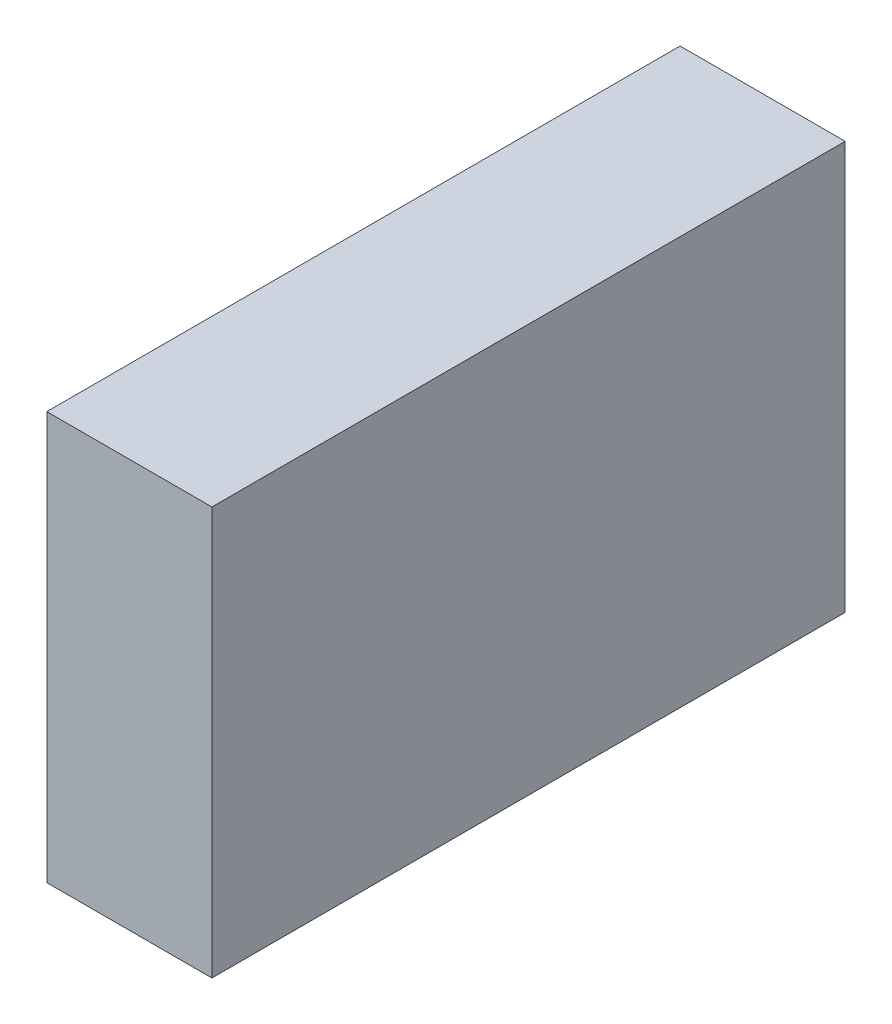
ISO-10303-21;
HEADER;
FILE_DESCRIPTION(('STEP AP214'),'2;1');
FILE_NAME('part.step','',(''),(''),'','','');
FILE_SCHEMA(('AUTOMOTIVE_DESIGN { 1 0 10303 214 1 1 1 1 }'));
ENDSEC;
DATA;
#1=APPLICATION_CONTEXT('core data for automotive mechanical design processes');
#2=APPLICATION_PROTOCOL_DEFINITION('international standard','automotive_design',2000,#1);
#3=PRODUCT_CONTEXT('',#1,'mechanical');
#4=PRODUCT('Part','Part','',(#3));
#5=PRODUCT_RELATED_PRODUCT_CATEGORY('part','',(#4));
#6=PRODUCT_DEFINITION_FORMATION('','',#4);
#7=PRODUCT_DEFINITION_CONTEXT('part definition',#1,'design');
#8=PRODUCT_DEFINITION('design','',#6,#7);
#9=PRODUCT_DEFINITION_SHAPE('','',#8);
#10=(LENGTH_UNIT() NAMED_UNIT(*) SI_UNIT(.MILLI.,.METRE.));
#11=(NAMED_UNIT(*) PLANE_ANGLE_UNIT() SI_UNIT($,.RADIAN.));
#12=(NAMED_UNIT(*) SI_UNIT($,.STERADIAN.) SOLID_ANGLE_UNIT());
#13=UNCERTAINTY_MEASURE_WITH_UNIT(LENGTH_MEASURE(1.E-05),#10,'distance_accuracy_value','');
#14=(GEOMETRIC_REPRESENTATION_CONTEXT(3) GLOBAL_UNCERTAINTY_ASSIGNED_CONTEXT((#13)) GLOBAL_UNIT_ASSIGNED_CONTEXT((#10,
#11,#12)) REPRESENTATION_CONTEXT('',''));
#15=CARTESIAN_POINT('',(0.,0.,0.));
#16=DIRECTION('',(0.,0.,1.));
#17=DIRECTION('',(1.,0.,0.));
#18=AXIS2_PLACEMENT_3D('',#15,#16,#17);
#19=CARTESIAN_POINT('',(-42.5,210.,-163.));
#20=DIRECTION('',(-1.,0.,0.));
#21=DIRECTION('',(0.,-1.,0.));
#22=AXIS2_PLACEMENT_3D('',#19,#20,#21);
#23=PLANE('',#22);
#24=DIRECTION('',(0.,-1.,0.));
#25=VECTOR('',#24,1.);
#26=CARTESIAN_POINT('',(-42.5,210.,163.));
#27=LINE('',#26,#25);
#28=CARTESIAN_POINT('',(-42.5,210.,163.));
#29=VERTEX_POINT('',#28);
#30=CARTESIAN_POINT('',(-42.5,0.,163.));
#31=VERTEX_POINT('',#30);
#32=EDGE_CURVE('E120',#29,#31,#27,.T.);
#33=ORIENTED_EDGE('',*,*,#32,.F.);
#34=DIRECTION('',(0.,0.,1.));
#35=VECTOR('',#34,1.);
#36=CARTESIAN_POINT('',(-42.5,210.,-163.));
#37=LINE('',#36,#35);
#38=CARTESIAN_POINT('',(-42.5,210.,-163.));
#39=VERTEX_POINT('',#38);
#40=EDGE_CURVE('E11',#39,#29,#37,.T.);
#41=ORIENTED_EDGE('',*,*,#40,.F.);
#42=DIRECTION('',(0.,-1.,0.));
#43=VECTOR('',#42,1.);
#44=CARTESIAN_POINT('',(-42.5,210.,-163.));
#45=LINE('',#44,#43);
#46=CARTESIAN_POINT('',(-42.5,0.,-163.));
#47=VERTEX_POINT('',#46);
#48=EDGE_CURVE('E107',#39,#47,#45,.T.);
#49=ORIENTED_EDGE('',*,*,#48,.T.);
#50=DIRECTION('',(0.,0.,1.));
#51=VECTOR('',#50,1.);
#52=CARTESIAN_POINT('',(-42.5,0.,-163.));
#53=LINE('',#52,#51);
#54=EDGE_CURVE('E52',#47,#31,#53,.T.);
#55=ORIENTED_EDGE('',*,*,#54,.T.);
#56=EDGE_LOOP('',(#33,#41,#49,#55));
#57=FACE_BOUND('',#56,.T.);
#58=ADVANCED_FACE('F49',(#57),#23,.T.);
#59=CARTESIAN_POINT('',(-42.5,210.,-163.));
#60=DIRECTION('',(0.,1.,0.));
#61=DIRECTION('',(-1.,0.,0.));
#62=AXIS2_PLACEMENT_3D('',#59,#60,#61);
#63=PLANE('',#62);
#64=ORIENTED_EDGE('',*,*,#40,.T.);
#65=DIRECTION('',(-1.,0.,0.));
#66=VECTOR('',#65,1.);
#67=CARTESIAN_POINT('',(-42.5,210.,163.));
#68=LINE('',#67,#66);
#69=CARTESIAN_POINT('',(42.5,210.,163.));
#70=VERTEX_POINT('',#69);
#71=EDGE_CURVE('E89',#70,#29,#68,.T.);
#72=ORIENTED_EDGE('',*,*,#71,.F.);
#73=DIRECTION('',(0.,0.,1.));
#74=VECTOR('',#73,1.);
#75=CARTESIAN_POINT('',(42.5,210.,-163.));
#76=LINE('',#75,#74);
#77=CARTESIAN_POINT('',(42.5,210.,-163.));
#78=VERTEX_POINT('',#77);
#79=EDGE_CURVE('E59',#78,#70,#76,.T.);
#80=ORIENTED_EDGE('',*,*,#79,.F.);
#81=DIRECTION('',(-1.,0.,0.));
#82=VECTOR('',#81,1.);
#83=CARTESIAN_POINT('',(-42.5,210.,-163.));
#84=LINE('',#83,#82);
#85=EDGE_CURVE('E67',#78,#39,#84,.T.);
#86=ORIENTED_EDGE('',*,*,#85,.T.);
#87=EDGE_LOOP('',(#64,#72,#80,#86));
#88=FACE_BOUND('',#87,.T.);
#89=ADVANCED_FACE('F134',(#88),#63,.T.);
#90=CARTESIAN_POINT('',(42.5,210.,-163.));
#91=DIRECTION('',(1.,0.,0.));
#92=DIRECTION('',(0.,1.,0.));
#93=AXIS2_PLACEMENT_3D('',#90,#91,#92);
#94=PLANE('',#93);
#95=DIRECTION('',(0.,1.,0.));
#96=VECTOR('',#95,1.);
#97=CARTESIAN_POINT('',(42.5,210.,163.));
#98=LINE('',#97,#96);
#99=CARTESIAN_POINT('',(42.5,0.,163.));
#100=VERTEX_POINT('',#99);
#101=EDGE_CURVE('E110',#100,#70,#98,.T.);
#102=ORIENTED_EDGE('',*,*,#101,.F.);
#103=DIRECTION('',(0.,0.,1.));
#104=VECTOR('',#103,1.);
#105=CARTESIAN_POINT('',(42.5,0.,-163.));
#106=LINE('',#105,#104);
#107=CARTESIAN_POINT('',(42.5,0.,-163.));
#108=VERTEX_POINT('',#107);
#109=EDGE_CURVE('E100',#108,#100,#106,.T.);
#110=ORIENTED_EDGE('',*,*,#109,.F.);
#111=DIRECTION('',(0.,1.,0.));
#112=VECTOR('',#111,1.);
#113=CARTESIAN_POINT('',(42.5,210.,-163.));
#114=LINE('',#113,#112);
#115=EDGE_CURVE('E106',#108,#78,#114,.T.);
#116=ORIENTED_EDGE('',*,*,#115,.T.);
#117=ORIENTED_EDGE('',*,*,#79,.T.);
#118=EDGE_LOOP('',(#102,#110,#116,#117));
#119=FACE_BOUND('',#118,.T.);
#120=ADVANCED_FACE('F109',(#119),#94,.T.);
#121=CARTESIAN_POINT('',(-42.5,0.,-163.));
#122=DIRECTION('',(0.,-1.,0.));
#123=DIRECTION('',(1.,0.,0.));
#124=AXIS2_PLACEMENT_3D('',#121,#122,#123);
#125=PLANE('',#124);
#126=DIRECTION('',(1.,0.,0.));
#127=VECTOR('',#126,1.);
#128=CARTESIAN_POINT('',(-42.5,0.,-163.));
#129=LINE('',#128,#127);
#130=EDGE_CURVE('E97',#47,#108,#129,.T.);
#131=ORIENTED_EDGE('',*,*,#130,.T.);
#132=ORIENTED_EDGE('',*,*,#109,.T.);
#133=DIRECTION('',(1.,0.,0.));
#134=VECTOR('',#133,1.);
#135=CARTESIAN_POINT('',(-42.5,0.,163.));
#136=LINE('',#135,#134);
#137=EDGE_CURVE('E123',#31,#100,#136,.T.);
#138=ORIENTED_EDGE('',*,*,#137,.F.);
#139=ORIENTED_EDGE('',*,*,#54,.F.);
#140=EDGE_LOOP('',(#131,#132,#138,#139));
#141=FACE_BOUND('',#140,.T.);
#142=ADVANCED_FACE('F99',(#141),#125,.T.);
#143=CARTESIAN_POINT('',(0.,0.,-163.));
#144=DIRECTION('',(0.,0.,1.));
#145=DIRECTION('',(1.,0.,0.));
#146=AXIS2_PLACEMENT_3D('',#143,#144,#145);
#147=PLANE('',#146);
#148=ORIENTED_EDGE('',*,*,#48,.F.);
#149=ORIENTED_EDGE('',*,*,#85,.F.);
#150=ORIENTED_EDGE('',*,*,#115,.F.);
#151=ORIENTED_EDGE('',*,*,#130,.F.);
#152=EDGE_LOOP('',(#148,#149,#150,#151));
#153=FACE_BOUND('',#152,.T.);
#154=ADVANCED_FACE('F112',(#153),#147,.F.);
#155=CARTESIAN_POINT('',(0.,0.,163.));
#156=DIRECTION('',(0.,0.,1.));
#157=DIRECTION('',(1.,0.,0.));
#158=AXIS2_PLACEMENT_3D('',#155,#156,#157);
#159=PLANE('',#158);
#160=ORIENTED_EDGE('',*,*,#137,.T.);
#161=ORIENTED_EDGE('',*,*,#101,.T.);
#162=ORIENTED_EDGE('',*,*,#71,.T.);
#163=ORIENTED_EDGE('',*,*,#32,.T.);
#164=EDGE_LOOP('',(#160,#161,#162,#163));
#165=FACE_BOUND('',#164,.T.);
#166=ADVANCED_FACE('F142',(#165),#159,.T.);
#167=CLOSED_SHELL('',(#58,#89,#120,#142,#154,#166));
#168=MANIFOLD_SOLID_BREP('B2',#167);
#169=ADVANCED_BREP_SHAPE_REPRESENTATION('',(#18,#168),#14);
#170=SHAPE_DEFINITION_REPRESENTATION(#9,#169);
ENDSEC;
END-ISO-10303-21;
